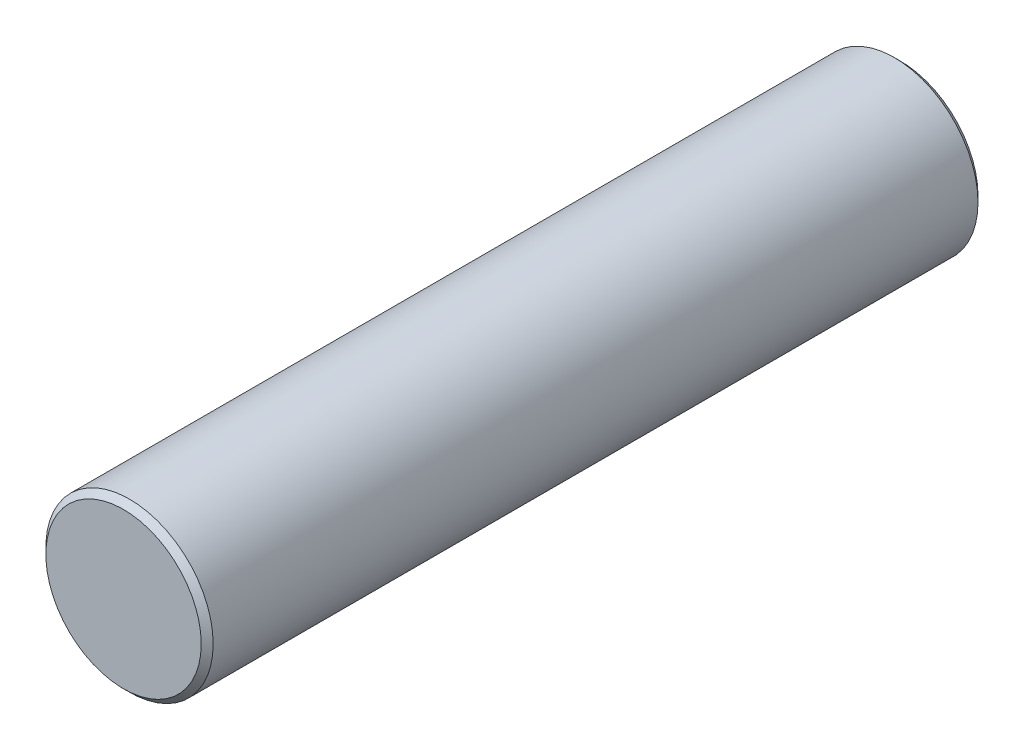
from build123d import *

# Parameters (mm, degrees)
SKETCH1_R           = 7
BOSS_EXTRUDE1_DEPTH = 32.5
CHAMFER1_SIZE       = 0.5


with BuildPart() as part:
    # Sketch1 → Boss-Extrude1 (new, symmetric)
    with BuildSketch(Plane.XY):
        Circle(SKETCH1_R)
    extrude(amount=BOSS_EXTRUDE1_DEPTH, both=True)

    # Chamfer1
    chamfer1_edges = [part.edges().sort_by_distance(p)[0] for p in [
        (-7, 0, -32.5),
        (-7, 0, 32.5),
    ]]
    chamfer(chamfer1_edges, length=CHAMFER1_SIZE)


solid = part.part
